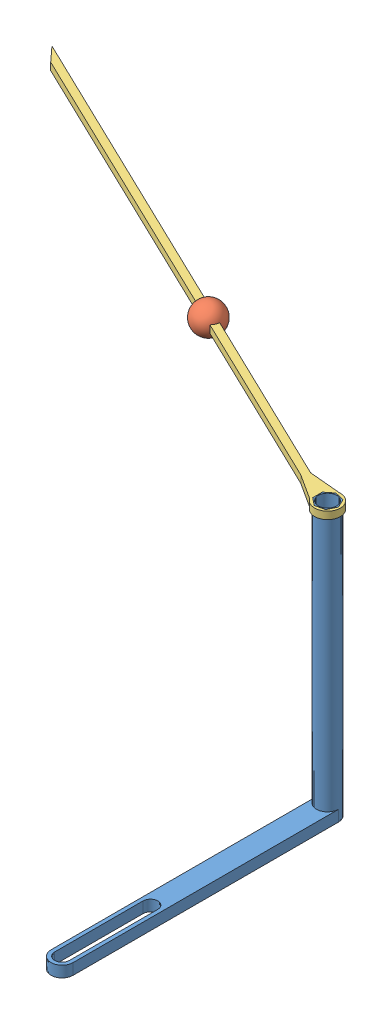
SolidWorks assembly Pointer Assembly Mercury.SLDASM, configuration Default (file format 6000). Lengths in mm.
Overall size (75.17 38.5 73.79).
3 component instances, 3 part files, 6 mates.
Components (placement in the parent):
- Rod Mercury-1: Rod Mercury.SLDPRT [Default] at (-16.5098 -16.7778 -10.4581) size (3 37 39)
- Orb Mercury-1: Orb Mercury.SLDPRT [Default] at (-46.5998 19.7222 -24.3937) x (-0.433884 0 0.900969) z (0.900969 0 0.433884) size (4 4 3.87)
- Pointer Mercury-1: Pointer Mercury.SLDPRT [Default] at (-16.5098 19.2222 -10.4581) x (-0.900969 0 -0.433884) z (0.433884 0 -0.900969) size (81.75 1 3.5)
Mates (geometry in assembly coordinates):
- Coincident1: coincident aligned: plane of Rod Mercury-1 through (-16.5098 20.2222 -10.4581) normal (0 1 0); plane of Pointer Mercury-1 through (-16.5098 20.2222 -10.4581) normal (0 1 0)
- Concentric1: concentric anti-aligned: cylinder of Rod Mercury-1 through (-16.5098 20.2222 -10.4581) axis (0 -1 0) radius 1.5; circle of Pointer Mercury-1
- Coincident2: coincident anti-aligned: plane of Rod Mercury-1 through (-17.3524 19.2222 -9.4015) normal (-0.62349 0 0.781831); plane of Pointer Mercury-1 through (-17.8613 20.2222 -9.8072) normal (0.62349 0 -0.781831)
- Coincident3: coincident anti-aligned: plane of Orb Mercury-1 through (-48.1857 20.2222 -25.7124) normal (0 -1 0); plane of Pointer Mercury-1 through (-16.5098 20.2222 -10.4581) normal (0 1 0)
- Coincident4: coincident anti-aligned: plane of Orb Mercury-1 through (-48.6195 20.2222 -24.8114) normal (0.433884 0 -0.900969); plane of Pointer Mercury-1 through (-86.7688 20.2222 -43.1831) normal (-0.433884 0 0.900969)
- Coincident6: coincident: point of Orb Mercury-1; point of Pointer Mercury-1
